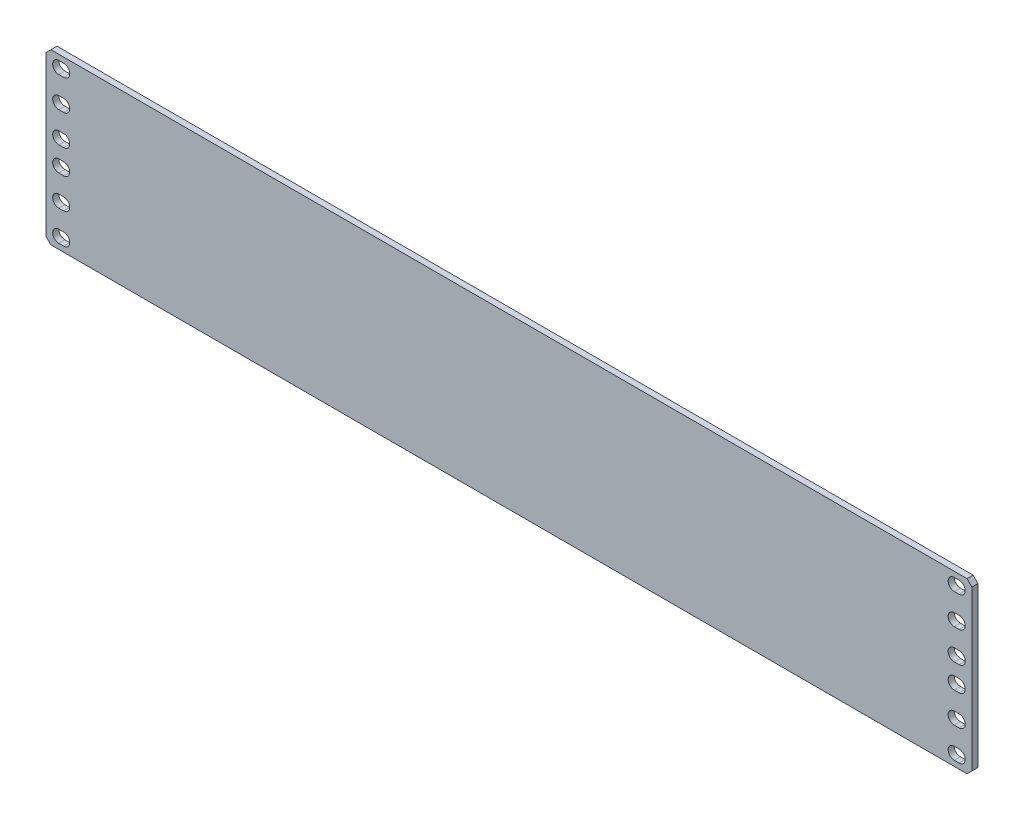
from build123d import *

# Parameters (mm, degrees)
SKETCH1_W           = 482.6
SKETCH1_H           = 88.10625
BOSS_EXTRUDE1_DEPTH = 3.175
CHAMFER1_SIZE       = 2.54
CUT_EXTRUDE2_REACH  = 247.309
LPATTERN1_COUNT     = 2
LPATTERN1_PITCH     = 44.45


with BuildPart() as part:
    # Sketch1 → Boss-Extrude1 (new body)
    with BuildSketch(Plane(origin=(0, 3.175, 0), x_dir=(1, 0, 0), z_dir=(0, 0, -1))):
        with Locations((0, 3.175)):
            Rectangle(SKETCH1_W, SKETCH1_H)
    extrude(amount=-BOSS_EXTRUDE1_DEPTH)

    # Chamfer1
    chamfer1_edges = [part.edges().sort_by_distance(p)[0] for p in [
        (241.3, 44.053125, 1.5875),
        (-241.3, 44.053125, 1.5875),
        (-241.3, -44.053125, 1.5875),
        (241.3, -44.053125, 1.5875),
    ]]
    chamfer(chamfer1_edges, length=CHAMFER1_SIZE)

    # Sketch6 → Cut-Extrude2 (cut, up to next)
    with BuildSketch(Plane.XY.offset(3.175), mode=Mode.PRIVATE) as cut_extrude2_sk1:
        with BuildLine():
            Line((-234.6325, -3.175), (-232.0925, -3.175))
            ThreePointArc((-232.0925, -3.175), (-228.9175, -6.35), (-232.0925, -9.525))
            Line((-232.0925, -9.525), (-234.6325, -9.525))
            ThreePointArc((-234.6325, -9.525), (-237.8075, -6.35), (-234.6325, -3.175))
        make_face()
    cut_extrude2_tool1 = extrude(cut_extrude2_sk1.sketch, amount=-CUT_EXTRUDE2_REACH, mode=Mode.PRIVATE) & part.part
    # Sketch6 → Cut-Extrude2 (cut, up to next)
    with BuildSketch(Plane.XY.offset(3.175), mode=Mode.PRIVATE) as cut_extrude2_sk2:
        with BuildLine():
            Line((-234.6325, -34.925), (-232.0925, -34.925))
            ThreePointArc((-232.0925, -34.925), (-228.9175, -38.1), (-232.0925, -41.275))
            Line((-232.0925, -41.275), (-234.6325, -41.275))
            ThreePointArc((-234.6325, -41.275), (-237.8075, -38.1), (-234.6325, -34.925))
        make_face()
    cut_extrude2_tool2 = extrude(cut_extrude2_sk2.sketch, amount=-CUT_EXTRUDE2_REACH, mode=Mode.PRIVATE) & part.part
    # Sketch6 → Cut-Extrude2 (cut, up to next)
    with BuildSketch(Plane.XY.offset(3.175), mode=Mode.PRIVATE) as cut_extrude2_sk3:
        with BuildLine():
            Line((232.0925, -3.175), (234.6325, -3.175))
            ThreePointArc((234.6325, -3.175), (237.8075, -6.35), (234.6325, -9.525))
            Line((234.6325, -9.525), (232.0925, -9.525))
            ThreePointArc((232.0925, -9.525), (228.9175, -6.35), (232.0925, -3.175))
        make_face()
    cut_extrude2_tool3 = extrude(cut_extrude2_sk3.sketch, amount=-CUT_EXTRUDE2_REACH, mode=Mode.PRIVATE) & part.part
    # Sketch6 → Cut-Extrude2 (cut, up to next)
    with BuildSketch(Plane.XY.offset(3.175), mode=Mode.PRIVATE) as cut_extrude2_sk4:
        with BuildLine():
            Line((232.0925, -34.925), (234.6325, -34.925))
            ThreePointArc((234.6325, -34.925), (237.8075, -38.1), (234.6325, -41.275))
            Line((234.6325, -41.275), (232.0925, -41.275))
            ThreePointArc((232.0925, -41.275), (228.9175, -38.1), (232.0925, -34.925))
        make_face()
    cut_extrude2_tool4 = extrude(cut_extrude2_sk4.sketch, amount=-CUT_EXTRUDE2_REACH, mode=Mode.PRIVATE) & part.part
    # Sketch6 → Cut-Extrude2 (cut, up to next)
    with BuildSketch(Plane.XY.offset(3.175), mode=Mode.PRIVATE) as cut_extrude2_sk5:
        with BuildLine():
            Line((-234.6325, -19.05), (-232.0925, -19.05))
            ThreePointArc((-232.0925, -19.05), (-228.9175, -22.225), (-232.0925, -25.4))
            Line((-232.0925, -25.4), (-234.6325, -25.4))
            ThreePointArc((-234.6325, -25.4), (-237.8075, -22.225), (-234.6325, -19.05))
        make_face()
    cut_extrude2_tool5 = extrude(cut_extrude2_sk5.sketch, amount=-CUT_EXTRUDE2_REACH, mode=Mode.PRIVATE) & part.part
    # Sketch6 → Cut-Extrude2 (cut, up to next)
    with BuildSketch(Plane.XY.offset(3.175), mode=Mode.PRIVATE) as cut_extrude2_sk6:
        with BuildLine():
            Line((232.0925, -19.05), (234.6325, -19.05))
            ThreePointArc((234.6325, -19.05), (237.8075, -22.225), (234.6325, -25.4))
            Line((234.6325, -25.4), (232.0925, -25.4))
            ThreePointArc((232.0925, -25.4), (228.9175, -22.225), (232.0925, -19.05))
        make_face()
    cut_extrude2_tool6 = extrude(cut_extrude2_sk6.sketch, amount=-CUT_EXTRUDE2_REACH, mode=Mode.PRIVATE) & part.part
    cut_extrude2_1 = cut_extrude2_tool1.solids().sort_by_distance((-233.3625, -6.35, 3.175))[0]
    add(cut_extrude2_1, mode=Mode.SUBTRACT)
    cut_extrude2_2 = cut_extrude2_tool2.solids().sort_by_distance((-233.3625, -38.1, 3.175))[0]
    add(cut_extrude2_2, mode=Mode.SUBTRACT)
    cut_extrude2_3 = cut_extrude2_tool3.solids().sort_by_distance((233.3625, -6.35, 3.175))[0]
    add(cut_extrude2_3, mode=Mode.SUBTRACT)
    cut_extrude2_4 = cut_extrude2_tool4.solids().sort_by_distance((233.3625, -38.1, 3.175))[0]
    add(cut_extrude2_4, mode=Mode.SUBTRACT)
    cut_extrude2_5 = cut_extrude2_tool5.solids().sort_by_distance((-233.3625, -22.225, 3.175))[0]
    add(cut_extrude2_5, mode=Mode.SUBTRACT)
    cut_extrude2_6 = cut_extrude2_tool6.solids().sort_by_distance((233.3625, -22.225, 3.175))[0]
    add(cut_extrude2_6, mode=Mode.SUBTRACT)
    cut_extrude2 = cut_extrude2_1 + cut_extrude2_2 + cut_extrude2_3 + cut_extrude2_4 + cut_extrude2_5 + cut_extrude2_6  # Cut-Extrude2 as one shape, for the pattern or mirror that repeats it

    # LPattern1: Cut-Extrude2 ×2
    with Locations(*[(0, i * LPATTERN1_PITCH, 0) for i in range(1, LPATTERN1_COUNT)]):
        add(cut_extrude2, mode=Mode.SUBTRACT)


solid = part.part
